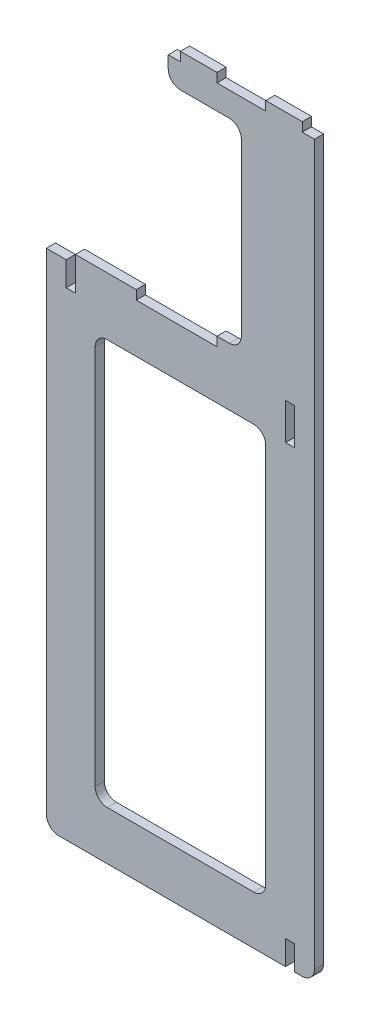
from build123d import *

# Parameters (mm, degrees)
SKETCH1_W                 = 558.8
SKETCH1_H                 = 1047.75
BOTTOM_EXTRUDE_DEPTH      = 19.05
SKETCH4_W                 = 355.6
SKETCH4_H                 = 844.55
INTERIOR_CUT_DEPTH        = 19.05
SKETCH5_W                 = 19.05
SKETCH5_H                 = 50.8
TOP_SUPPORT_SLOT_DEPTH    = 595.030536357
SKETCH7_W                 = 127
SKETCH7_H                 = 19.05
FRONT_TABLE_TAB_DEPTH     = 19.05
FILLET1_R                 = 25.4
SKETCH8_W                 = 19.05
SKETCH8_H                 = 50.8
BOTTOM_SUPPORT_SLOT_DEPTH = 611.896732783
SKETCH9_W                 = 152.4
SKETCH9_H                 = 406.4
BOSS_EXTRUDE3_DEPTH       = 19.05
SKETCH10_W                = 304.8
SKETCH10_H                = 50.8
BOSS_EXTRUDE4_DEPTH       = 19.05
FILLET2_R                 = 25.4
FILLET3_R                 = 25.4
SKETCH11_W                = 76.2
SKETCH11_H                = 19.05
BOSS_EXTRUDE5_DEPTH       = 19.05
FILLET4_R                 = 25.4
SKETCH12_W                = 19.05
SKETCH12_H                = 76.2
CUT_EXTRUDE5_DEPTH        = 1057.950776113


with BuildPart() as part:
    # Sketch1 → bottom_extrude (new body)
    with BuildSketch(Plane.XY):
        Rectangle(SKETCH1_W, SKETCH1_H)
    extrude(amount=BOTTOM_EXTRUDE_DEPTH)

    # Sketch4 → interior_cut (cut)
    with BuildSketch(Plane.XY.offset(19.05)):
        Rectangle(SKETCH4_W, SKETCH4_H)
    extrude(amount=-INTERIOR_CUT_DEPTH, mode=Mode.SUBTRACT)

    # Sketch5 → top_support_slot (cut, through all)
    with BuildSketch(Plane.XY.offset(19.05)):
        with Locations((-228.6, 498.475)):
            Rectangle(SKETCH5_W, SKETCH5_H)
    extrude(amount=-TOP_SUPPORT_SLOT_DEPTH, mode=Mode.SUBTRACT)

    # Sketch7 → front_table_tab (add)
    with BuildSketch(Plane.XY.offset(19.05)):
        with Locations((-155.575, 533.4)):
            Rectangle(SKETCH7_W, SKETCH7_H)
    extrude(amount=-FRONT_TABLE_TAB_DEPTH)

    # Fillet1
    fillet1_edges = [part.edges().sort_by_distance(p)[0] for p in [
        (279.4, -523.875, 9.525),
        (-279.4, -523.875, 9.525),
    ]]
    fillet(fillet1_edges, radius=FILLET1_R)

    # Sketch8 → bottom_support_slot (cut, through all)
    with BuildSketch(Plane.XY.offset(19.05)):
        with Locations((228.6, -498.475)):
            Rectangle(SKETCH8_W, SKETCH8_H)
    extrude(amount=-BOTTOM_SUPPORT_SLOT_DEPTH, mode=Mode.SUBTRACT)

    # Sketch9 → Boss-Extrude3 (add)
    with BuildSketch(Plane.XY.offset(19.05)):
        with Locations((203.2, 746.125)):
            Rectangle(SKETCH9_W, SKETCH9_H)
        Polygon((76.2, 523.875), (279.4, 523.875), (279.4, 542.925), (127, 542.925), (76.2, 542.925), align=None)
    extrude(amount=-BOSS_EXTRUDE3_DEPTH)

    # Sketch10 → Boss-Extrude4 (add)
    with BuildSketch(Plane.XY.offset(19.05)):
        with Locations((127, 974.725)):
            Rectangle(SKETCH10_W, SKETCH10_H)
    extrude(amount=-BOSS_EXTRUDE4_DEPTH)

    # Fillet2
    fillet2_edges = [part.edges().sort_by_distance(p)[0] for p in [
        (127, 542.925, 9.525),
    ]]
    fillet(fillet2_edges, radius=FILLET2_R)

    # Fillet3
    fillet3_edges = [part.edges().sort_by_distance(p)[0] for p in [
        (127, 949.325, 9.525),
        (-25.4, 949.325, 9.525),
    ]]
    fillet(fillet3_edges, radius=FILLET3_R)

    # Sketch11 → Boss-Extrude5 (add)
    with BuildSketch(Plane.XY.offset(19.05)):
        with Locations((38.1, 1009.65)):
            Rectangle(SKETCH11_W, SKETCH11_H)
        with Locations((215.9, 1009.65)):
            Rectangle(SKETCH11_W, SKETCH11_H)
    extrude(amount=-BOSS_EXTRUDE5_DEPTH)

    # Fillet4
    fillet4_edges = [part.edges().sort_by_distance(p)[0] for p in [
        (177.8, 422.275, 9.525),
        (177.8, -422.275, 9.525),
        (-177.8, -422.275, 9.525),
        (-177.8, 422.275, 9.525),
    ]]
    fillet(fillet4_edges, radius=FILLET4_R)

    # Sketch12 → Cut-Extrude5 (cut, through all)
    with BuildSketch(Plane.XY.offset(19.05)):
        with Locations((228.6, 460.375)):
            Rectangle(SKETCH12_W, SKETCH12_H)
    extrude(amount=-CUT_EXTRUDE5_DEPTH, mode=Mode.SUBTRACT)


solid = part.part
